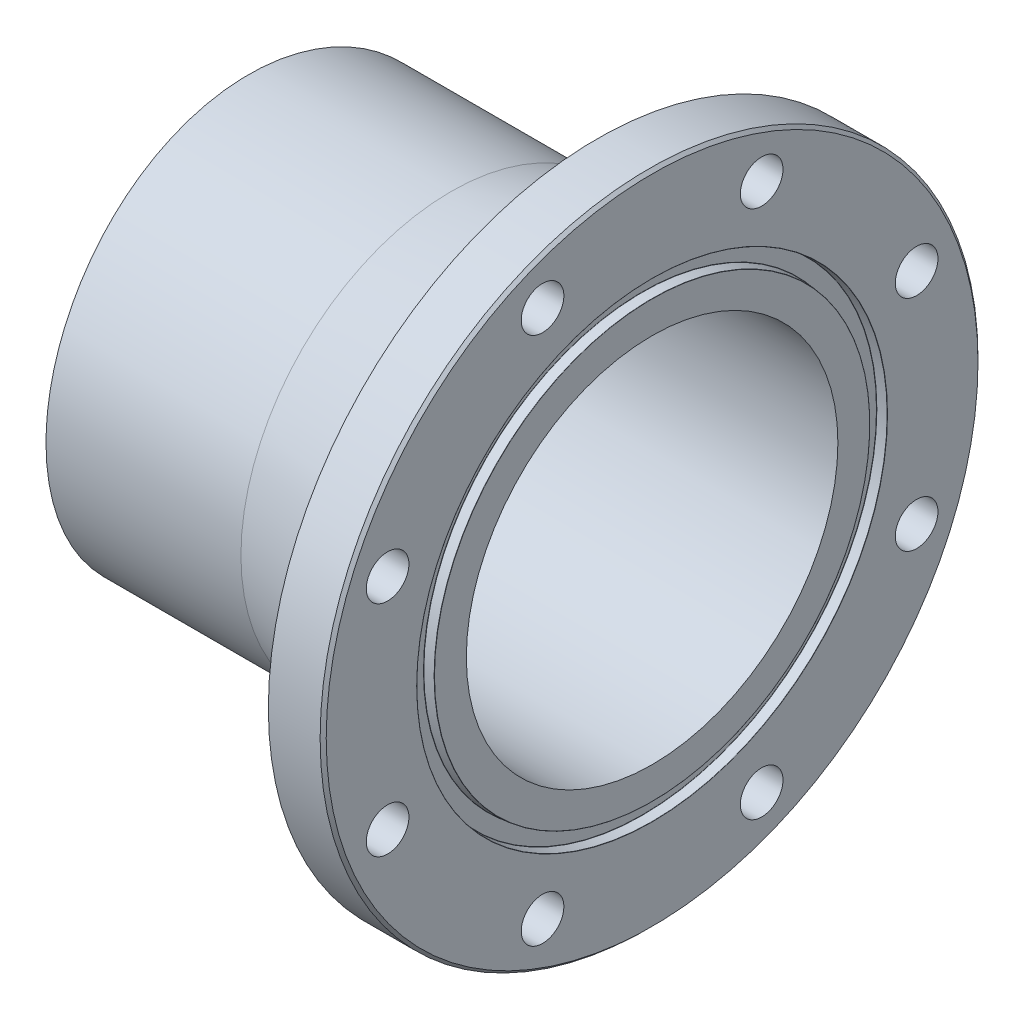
ISO-10303-21;
HEADER;
FILE_DESCRIPTION(('STEP AP214'),'2;1');
FILE_NAME('part.step','',(''),(''),'','','');
FILE_SCHEMA(('AUTOMOTIVE_DESIGN { 1 0 10303 214 1 1 1 1 }'));
ENDSEC;
DATA;
#1=APPLICATION_CONTEXT('core data for automotive mechanical design processes');
#2=APPLICATION_PROTOCOL_DEFINITION('international standard','automotive_design',2000,#1);
#3=PRODUCT_CONTEXT('',#1,'mechanical');
#4=PRODUCT('Part','Part','',(#3));
#5=PRODUCT_RELATED_PRODUCT_CATEGORY('part','',(#4));
#6=PRODUCT_DEFINITION_FORMATION('','',#4);
#7=PRODUCT_DEFINITION_CONTEXT('part definition',#1,'design');
#8=PRODUCT_DEFINITION('design','',#6,#7);
#9=PRODUCT_DEFINITION_SHAPE('','',#8);
#10=(LENGTH_UNIT() NAMED_UNIT(*) SI_UNIT(.MILLI.,.METRE.));
#11=(NAMED_UNIT(*) PLANE_ANGLE_UNIT() SI_UNIT($,.RADIAN.));
#12=(NAMED_UNIT(*) SI_UNIT($,.STERADIAN.) SOLID_ANGLE_UNIT());
#13=UNCERTAINTY_MEASURE_WITH_UNIT(LENGTH_MEASURE(1.E-05),#10,'distance_accuracy_value','');
#14=(GEOMETRIC_REPRESENTATION_CONTEXT(3) GLOBAL_UNCERTAINTY_ASSIGNED_CONTEXT((#13)) GLOBAL_UNIT_ASSIGNED_CONTEXT((#10,
#11,#12)) REPRESENTATION_CONTEXT('',''));
#15=CARTESIAN_POINT('',(0.,0.,0.));
#16=DIRECTION('',(0.,0.,1.));
#17=DIRECTION('',(1.,0.,0.));
#18=AXIS2_PLACEMENT_3D('',#15,#16,#17);
#19=CARTESIAN_POINT('',(0.,0.,0.));
#20=DIRECTION('',(-1.,0.,0.));
#21=DIRECTION('',(0.,0.,1.));
#22=AXIS2_PLACEMENT_3D('',#19,#20,#21);
#23=CYLINDRICAL_SURFACE('',#22,96.8375);
#24=CARTESIAN_POINT('',(12.6999999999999,0.,96.8375));
#25=CARTESIAN_POINT('',(12.7000002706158,1.35874619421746,96.8375016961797));
#26=CARTESIAN_POINT('',(12.6981819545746,2.71744447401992,96.8089000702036));
#27=CARTESIAN_POINT('',(12.6909219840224,5.43254151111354,96.6945452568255));
#28=CARTESIAN_POINT('',(12.6854800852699,6.78894010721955,96.6087882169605));
#29=CARTESIAN_POINT('',(12.6710097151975,9.49713625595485,96.3802512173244));
#30=CARTESIAN_POINT('',(12.6619806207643,10.848932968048,96.2374613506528));
#31=CARTESIAN_POINT('',(12.6403989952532,13.5454174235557,95.8951004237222));
#32=CARTESIAN_POINT('',(12.6278461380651,14.8901044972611,95.6955241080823));
#33=CARTESIAN_POINT('',(12.5992923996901,17.5711586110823,95.2397319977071));
#34=CARTESIAN_POINT('',(12.5832881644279,18.9075162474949,94.983461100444));
#35=CARTESIAN_POINT('',(12.5479509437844,21.5683304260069,94.4148268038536));
#36=CARTESIAN_POINT('',(12.5286176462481,22.8927858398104,94.1024581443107));
#37=CARTESIAN_POINT('',(12.4867639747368,25.5271037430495,93.4222600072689));
#38=CARTESIAN_POINT('',(12.4642441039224,26.8369685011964,93.0544392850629));
#39=CARTESIAN_POINT('',(12.4161726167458,29.4401112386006,92.2639244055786));
#40=CARTESIAN_POINT('',(12.3906207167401,30.7333876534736,91.841225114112));
#41=CARTESIAN_POINT('',(12.3366844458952,33.3001598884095,90.9420082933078));
#42=CARTESIAN_POINT('',(12.3083017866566,34.573667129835,90.4655232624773));
#43=CARTESIAN_POINT('',(12.2488896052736,37.0995562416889,89.4593351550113));
#44=CARTESIAN_POINT('',(12.2178598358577,38.3519361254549,88.9296271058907));
#45=CARTESIAN_POINT('',(12.1533780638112,40.8331345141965,87.8180184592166));
#46=CARTESIAN_POINT('',(12.1199262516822,42.0619548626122,87.2361219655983));
#47=CARTESIAN_POINT('',(12.0508322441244,44.4940684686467,86.0210869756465));
#48=CARTESIAN_POINT('',(12.0151898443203,45.6973593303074,85.3879436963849));
#49=CARTESIAN_POINT('',(11.9419809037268,48.0757997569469,84.0717868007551));
#50=CARTESIAN_POINT('',(11.9044150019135,49.2509584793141,83.3887897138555));
#51=CARTESIAN_POINT('',(11.8276145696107,51.5714874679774,81.973963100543));
#52=CARTESIAN_POINT('',(11.7883798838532,52.7168549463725,81.2421290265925));
#53=CARTESIAN_POINT('',(11.6685929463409,56.1049720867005,78.9754008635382));
#54=CARTESIAN_POINT('',(11.5859377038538,58.3003824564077,77.3689232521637));
#55=CARTESIAN_POINT('',(11.4172832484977,62.5508506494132,73.9750065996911));
#56=CARTESIAN_POINT('',(11.3312796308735,64.6057130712,72.1873238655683));
#57=CARTESIAN_POINT('',(11.1584582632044,68.5576759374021,68.4452379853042));
#58=CARTESIAN_POINT('',(11.0716405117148,70.4547761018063,66.490834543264));
#59=CARTESIAN_POINT('',(10.8996507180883,74.0777552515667,62.4291135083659));
#60=CARTESIAN_POINT('',(10.8144787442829,75.8036271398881,60.3217895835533));
#61=CARTESIAN_POINT('',(10.6481987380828,79.0718569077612,55.9691819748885));
#62=CARTESIAN_POINT('',(10.5670907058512,80.614214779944,53.7238982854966));
#63=CARTESIAN_POINT('',(10.4111760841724,83.5056619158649,49.1093244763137));
#64=CARTESIAN_POINT('',(10.336374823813,84.854588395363,46.7399321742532));
#65=CARTESIAN_POINT('',(10.1952793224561,87.3480118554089,41.895670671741));
#66=CARTESIAN_POINT('',(10.1289850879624,88.4925086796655,39.4208013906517));
#67=CARTESIAN_POINT('',(10.0067943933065,90.5688670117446,34.3831914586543));
#68=CARTESIAN_POINT('',(9.95089784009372,91.5007304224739,31.8204515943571));
#69=CARTESIAN_POINT('',(9.8510977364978,93.145139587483,26.6253208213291));
#70=CARTESIAN_POINT('',(9.80719416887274,93.8576856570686,23.9929300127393));
#71=CARTESIAN_POINT('',(9.7326857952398,95.0575088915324,18.6808899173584));
#72=CARTESIAN_POINT('',(9.70206294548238,95.5450917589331,16.0013099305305));
#73=CARTESIAN_POINT('',(9.65490291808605,96.2929071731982,10.6104880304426));
#74=CARTESIAN_POINT('',(9.63836572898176,96.5531399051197,7.89924614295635));
#75=CARTESIAN_POINT('',(9.61984936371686,96.8443762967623,2.46445743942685));
#76=CARTESIAN_POINT('',(9.61787003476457,96.8753823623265,-0.25908924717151));
#77=CARTESIAN_POINT('',(9.62852554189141,96.7079478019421,-5.69909063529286));
#78=CARTESIAN_POINT('',(9.64116036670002,96.5095073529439,-8.4155453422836));
#79=CARTESIAN_POINT('',(9.68065445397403,95.8850677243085,-13.8180580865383));
#80=CARTESIAN_POINT('',(9.7074929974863,95.4593999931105,-16.5041545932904));
#81=CARTESIAN_POINT('',(9.77461790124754,94.3837735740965,-21.8308825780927));
#82=CARTESIAN_POINT('',(9.81490424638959,93.7338151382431,-24.4715141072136));
#83=CARTESIAN_POINT('',(9.90777947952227,92.2142638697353,-29.6885961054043));
#84=CARTESIAN_POINT('',(9.96036842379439,91.3446700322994,-32.2650462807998));
#85=CARTESIAN_POINT('',(10.0763552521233,89.3920659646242,-37.3355132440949));
#86=CARTESIAN_POINT('',(10.139753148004,88.3090555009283,-39.829529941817));
#87=CARTESIAN_POINT('',(10.2756092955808,85.9364722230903,-44.7192825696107));
#88=CARTESIAN_POINT('',(10.3480741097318,84.646749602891,-47.1149456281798));
#89=CARTESIAN_POINT('',(10.4999724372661,81.8704806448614,-51.7891374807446));
#90=CARTESIAN_POINT('',(10.5794059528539,80.3839342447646,-54.0676662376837));
#91=CARTESIAN_POINT('',(10.7429924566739,77.2245441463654,-58.491532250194));
#92=CARTESIAN_POINT('',(10.8271454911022,75.5516986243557,-60.6368682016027));
#93=CARTESIAN_POINT('',(10.9977892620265,72.0315546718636,-64.7791952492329));
#94=CARTESIAN_POINT('',(11.0842800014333,70.184256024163,-66.776186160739));
#95=CARTESIAN_POINT('',(11.2573074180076,66.3248250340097,-70.6111365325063));
#96=CARTESIAN_POINT('',(11.3438439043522,64.3124060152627,-72.4488075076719));
#97=CARTESIAN_POINT('',(11.5143549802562,60.1398291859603,-75.9481155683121));
#98=CARTESIAN_POINT('',(11.5983295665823,57.979671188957,-77.6097524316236));
#99=CARTESIAN_POINT('',(11.7613358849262,53.5269045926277,-80.7451943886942));
#100=CARTESIAN_POINT('',(11.8403676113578,51.2342958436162,-82.2189992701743));
#101=CARTESIAN_POINT('',(11.9912468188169,46.5328694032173,-84.9682820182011));
#102=CARTESIAN_POINT('',(12.0630943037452,44.124051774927,-86.2437599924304));
#103=CARTESIAN_POINT('',(12.1975704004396,39.2071541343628,-88.5873463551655));
#104=CARTESIAN_POINT('',(12.2601985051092,36.6990686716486,-89.6554433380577));
#105=CARTESIAN_POINT('',(12.3744530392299,31.6015786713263,-91.57652734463));
#106=CARTESIAN_POINT('',(12.4260794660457,29.0121741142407,-92.4295143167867));
#107=CARTESIAN_POINT('',(12.5168634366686,23.770504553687,-93.914239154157));
#108=CARTESIAN_POINT('',(12.5560211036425,21.1182401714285,-94.5459792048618));
#109=CARTESIAN_POINT('',(12.620754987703,15.7697405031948,-95.5836673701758));
#110=CARTESIAN_POINT('',(12.6463312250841,13.0735052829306,-95.9896158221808));
#111=CARTESIAN_POINT('',(12.683142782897,7.66104309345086,-96.5722811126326));
#112=CARTESIAN_POINT('',(12.6944030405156,4.94485919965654,-96.7493965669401));
#113=CARTESIAN_POINT('',(12.7023455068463,-0.492798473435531,-96.8744262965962));
#114=CARTESIAN_POINT('',(12.6990277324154,-3.21427224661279,-96.8223408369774));
#115=CARTESIAN_POINT('',(12.6779082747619,-8.64311230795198,-96.4893454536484));
#116=CARTESIAN_POINT('',(12.6601066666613,-11.3504786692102,-96.2084367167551));
#117=CARTESIAN_POINT('',(12.6105243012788,-16.7318446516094,-95.4198199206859));
#118=CARTESIAN_POINT('',(12.5787435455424,-19.4058442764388,-94.912111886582));
#119=CARTESIAN_POINT('',(12.5021350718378,-24.6992814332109,-93.6740581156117));
#120=CARTESIAN_POINT('',(12.4573181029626,-27.3187620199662,-92.9438957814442));
#121=CARTESIAN_POINT('',(12.3558944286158,-32.4868571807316,-91.2660212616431));
#122=CARTESIAN_POINT('',(12.2992877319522,-35.0354718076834,-90.318309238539));
#123=CARTESIAN_POINT('',(12.1758835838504,-40.043821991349,-88.212095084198));
#124=CARTESIAN_POINT('',(12.1090860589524,-42.5035569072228,-87.0535914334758));
#125=CARTESIAN_POINT('',(11.9671866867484,-47.3167586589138,-84.534043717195));
#126=CARTESIAN_POINT('',(11.8920848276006,-49.6702253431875,-83.1729993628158));
#127=CARTESIAN_POINT('',(11.7355884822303,-54.2574532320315,-80.2560166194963));
#128=CARTESIAN_POINT('',(11.6541854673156,-56.4910450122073,-78.6998122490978));
#129=CARTESIAN_POINT('',(11.4874804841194,-60.8192456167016,-75.4050265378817));
#130=CARTESIAN_POINT('',(11.402178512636,-62.9138543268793,-73.6664450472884));
#131=CARTESIAN_POINT('',(11.2300880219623,-66.9493154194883,-70.0191936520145));
#132=CARTESIAN_POINT('',(11.1432994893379,-68.8901664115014,-68.1105222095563));
#133=CARTESIAN_POINT('',(10.9706926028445,-72.6043789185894,-64.1365921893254));
#134=CARTESIAN_POINT('',(10.884874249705,-74.3777403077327,-62.0713334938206));
#135=CARTESIAN_POINT('',(10.7165168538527,-77.7468481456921,-57.7957396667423));
#136=CARTESIAN_POINT('',(10.6339827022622,-79.3423356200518,-55.585200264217));
#137=CARTESIAN_POINT('',(10.4746705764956,-82.3414111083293,-51.0373661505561));
#138=CARTESIAN_POINT('',(10.3978926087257,-83.7449989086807,-48.7000712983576));
#139=CARTESIAN_POINT('',(10.2522783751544,-86.3502591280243,-43.915309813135));
#140=CARTESIAN_POINT('',(10.1834420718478,-87.5519325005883,-41.4678437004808));
#141=CARTESIAN_POINT('',(10.0556725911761,-89.7447743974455,-36.480109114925));
#142=CARTESIAN_POINT('',(9.99673940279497,-90.7359431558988,-33.939840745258));
#143=CARTESIAN_POINT('',(9.89049760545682,-92.5000048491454,-28.786493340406));
#144=CARTESIAN_POINT('',(9.84318035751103,-93.2730600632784,-26.1734700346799));
#145=CARTESIAN_POINT('',(9.76146359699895,-94.5963208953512,-20.8913929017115));
#146=CARTESIAN_POINT('',(9.72706408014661,-95.1465265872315,-18.2223390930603));
#147=CARTESIAN_POINT('',(9.67216563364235,-96.0201190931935,-12.8472473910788));
#148=CARTESIAN_POINT('',(9.65166658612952,-96.3435078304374,-10.1412098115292));
#149=CARTESIAN_POINT('',(9.62515465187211,-96.7611384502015,-4.71144011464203));
#150=CARTESIAN_POINT('',(9.61914174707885,-96.8553806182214,-1.98770801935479));
#151=CARTESIAN_POINT('',(9.62177157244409,-96.8140750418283,3.453174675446));
#152=CARTESIAN_POINT('',(9.63038835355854,-96.6789341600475,6.17032838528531));
#153=CARTESIAN_POINT('',(9.6619823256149,-96.1806137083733,11.5835562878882));
#154=CARTESIAN_POINT('',(9.68495949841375,-95.817434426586,14.2796305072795));
#155=CARTESIAN_POINT('',(9.74461984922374,-94.8656491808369,19.6315365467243));
#156=CARTESIAN_POINT('',(9.78130304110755,-94.2770429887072,22.2873683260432));
#157=CARTESIAN_POINT('',(9.86733146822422,-92.878629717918,27.5399314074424));
#158=CARTESIAN_POINT('',(9.91667671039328,-92.068822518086,30.136662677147));
#159=CARTESIAN_POINT('',(10.0266260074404,-90.2338134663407,35.2525913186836));
#160=CARTESIAN_POINT('',(10.087229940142,-89.2086139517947,37.771789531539));
#161=CARTESIAN_POINT('',(10.2179762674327,-86.9501384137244,42.7148527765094));
#162=CARTESIAN_POINT('',(10.2881186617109,-85.7168623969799,45.1387178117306));
#163=CARTESIAN_POINT('',(10.4359525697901,-83.051018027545,49.8739558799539));
#164=CARTESIAN_POINT('',(10.5136438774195,-81.6184551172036,52.1853319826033));
#165=CARTESIAN_POINT('',(10.6743739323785,-78.5642612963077,56.6792765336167));
#166=CARTESIAN_POINT('',(10.7574126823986,-76.942630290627,58.8618449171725));
#167=CARTESIAN_POINT('',(10.9266445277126,-73.5185906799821,63.0866139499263));
#168=CARTESIAN_POINT('',(11.0128426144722,-71.7158874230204,65.1285763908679));
#169=CARTESIAN_POINT('',(11.1425459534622,-68.8882100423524,68.0717959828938));
#170=CARTESIAN_POINT('',(11.1858540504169,-67.9249070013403,69.0330384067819));
#171=CARTESIAN_POINT('',(11.2723039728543,-65.9586777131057,70.9140636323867));
#172=CARTESIAN_POINT('',(11.3154458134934,-64.9557551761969,71.8338502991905));
#173=CARTESIAN_POINT('',(11.4012724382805,-62.9116978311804,73.6306473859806));
#174=CARTESIAN_POINT('',(11.4439570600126,-61.8705499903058,74.5076429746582));
#175=CARTESIAN_POINT('',(11.528548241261,-59.7522889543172,76.2169093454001));
#176=CARTESIAN_POINT('',(11.5704548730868,-58.6751791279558,77.0491842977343));
#177=CARTESIAN_POINT('',(11.6531998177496,-56.4867265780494,78.6676776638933));
#178=CARTESIAN_POINT('',(11.6940380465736,-55.3753811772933,79.4538924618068));
#179=CARTESIAN_POINT('',(11.7743492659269,-53.1206086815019,80.97872831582));
#180=CARTESIAN_POINT('',(11.8138223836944,-51.9771845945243,81.7173538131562));
#181=CARTESIAN_POINT('',(11.8911789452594,-49.6586303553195,83.1467318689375));
#182=CARTESIAN_POINT('',(11.9290601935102,-48.4834598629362,83.8374191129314));
#183=CARTESIAN_POINT('',(12.002903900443,-46.1050793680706,85.1685389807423));
#184=CARTESIAN_POINT('',(12.0388665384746,-44.9018720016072,85.8089763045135));
#185=CARTESIAN_POINT('',(12.1086264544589,-42.4692556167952,87.0386203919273));
#186=CARTESIAN_POINT('',(12.142423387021,-41.2398424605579,87.6278189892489));
#187=CARTESIAN_POINT('',(12.2076019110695,-38.7573033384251,88.7537625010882));
#188=CARTESIAN_POINT('',(12.2389837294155,-37.5041796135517,89.2905123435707));
#189=CARTESIAN_POINT('',(12.2990823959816,-34.977583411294,90.3101548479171));
#190=CARTESIAN_POINT('',(12.3278018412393,-33.7041322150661,90.7931000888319));
#191=CARTESIAN_POINT('',(12.3824038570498,-31.138062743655,91.70483244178));
#192=CARTESIAN_POINT('',(12.4082866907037,-29.8454462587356,92.1336245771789));
#193=CARTESIAN_POINT('',(12.4570302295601,-27.2434508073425,92.9362634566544));
#194=CARTESIAN_POINT('',(12.479891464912,-25.9340748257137,93.3101198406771));
#195=CARTESIAN_POINT('',(12.522432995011,-23.3007903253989,94.0022761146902));
#196=CARTESIAN_POINT('',(12.5421135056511,-21.9768827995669,94.320579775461));
#197=CARTESIAN_POINT('',(12.5830871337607,-18.9527329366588,94.9805316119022));
#198=CARTESIAN_POINT('',(12.6033479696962,-17.2486392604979,95.3047351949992));
#199=CARTESIAN_POINT('',(12.638244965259,-13.8258579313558,95.8611123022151));
#200=CARTESIAN_POINT('',(12.6528823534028,-12.1071735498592,96.0933059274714));
#201=CARTESIAN_POINT('',(12.6763710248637,-8.65978100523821,96.4650987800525));
#202=CARTESIAN_POINT('',(12.6852223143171,-6.931072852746,96.6046981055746));
#203=CARTESIAN_POINT('',(12.6970372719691,-3.46821785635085,96.7909077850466));
#204=CARTESIAN_POINT('',(12.6999996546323,-1.73406990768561,96.837497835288));
#205=CARTESIAN_POINT('',(12.6999999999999,0.,96.8375));
#206=B_SPLINE_CURVE_WITH_KNOTS('',3,(#24,#25,#26,#27,#28,#29,#30,#31,#32,#33,#34,#35,#36,#37,
#38,#39,#40,#41,#42,#43,#44,#45,#46,#47,#48,#49,#50,#51,#52,#53,#54,#55,#56,#57,#58,#59,#60,#61,
#62,#63,#64,#65,#66,#67,#68,#69,#70,#71,#72,#73,#74,#75,#76,#77,#78,#79,#80,#81,#82,#83,#84,#85,
#86,#87,#88,#89,#90,#91,#92,#93,#94,#95,#96,#97,#98,#99,#100,#101,#102,#103,#104,#105,#106,#107,
#108,#109,#110,#111,#112,#113,#114,#115,#116,#117,#118,#119,#120,#121,#122,#123,#124,#125,#126,
#127,#128,#129,#130,#131,#132,#133,#134,#135,#136,#137,#138,#139,#140,#141,#142,#143,#144,#145,
#146,#147,#148,#149,#150,#151,#152,#153,#154,#155,#156,#157,#158,#159,#160,#161,#162,#163,#164,
#165,#166,#167,#168,#169,#170,#171,#172,#173,#174,#175,#176,#177,#178,#179,#180,#181,#182,#183,
#184,#185,#186,#187,#188,#189,#190,#191,#192,#193,#194,#195,#196,#197,#198,#199,#200,#201,#202,
#203,#204,#205),.UNSPECIFIED.,.T.,.F.,(4,2,2,2,2,2,2,2,2,2,2,2,2,2,2,2,2,2,2,2,2,2,2,2,2,2,2,2,
2,2,2,2,2,2,2,2,2,2,2,2,2,2,2,2,2,2,2,2,2,2,2,2,2,2,2,2,2,2,2,2,2,2,2,2,2,2,2,2,2,2,2,2,2,2,2,2,
2,2,2,2,2,2,2,2,2,2,2,2,2,2,4),(0.,4.07585354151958,8.15198183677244,12.228818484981,
16.3060325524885,20.3872268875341,24.4688041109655,28.5497375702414,32.6310530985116,
36.709915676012,40.7891596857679,44.8680831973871,48.9473878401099,53.0253460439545,
57.1036845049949,65.2581525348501,73.4237363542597,81.5893346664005,89.7552712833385,
97.9212082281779,106.093977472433,114.266752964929,122.439455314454,130.612145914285,
138.773697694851,146.935242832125,155.096702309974,163.258155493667,171.407736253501,
179.557307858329,187.706916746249,195.856534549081,204.012085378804,212.167638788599,
220.323272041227,228.478915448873,236.649030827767,244.819156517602,252.989291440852,
261.159421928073,269.330001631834,277.500583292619,285.671084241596,293.841572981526,
301.997809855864,310.154037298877,318.310222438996,326.466406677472,334.615884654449,
342.765356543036,350.914887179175,359.064429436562,367.225201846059,375.38598095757,
383.546833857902,391.707692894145,399.880282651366,408.052881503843,416.225441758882,
424.397992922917,432.564447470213,440.730899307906,448.897281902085,457.063654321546,
465.215556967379,473.367449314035,481.519349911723,489.671254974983,497.823071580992,
505.974887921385,514.126481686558,522.278079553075,530.443163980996,534.526823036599,
538.610100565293,542.694783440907,546.779084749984,550.863706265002,554.947946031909,
559.037645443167,563.126961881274,567.216928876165,571.306511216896,575.39206140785,
579.477232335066,583.56168555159,587.645861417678,592.847587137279,598.04817582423,
603.24875899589,608.450477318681),.UNSPECIFIED.);
#207=CARTESIAN_POINT('',(12.6999999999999,0.,96.8375));
#208=VERTEX_POINT('',#207);
#209=EDGE_CURVE('E76',#208,#208,#206,.T.);
#210=ORIENTED_EDGE('',*,*,#209,.T.);
#211=EDGE_LOOP('',(#210));
#212=FACE_BOUND('',#211,.T.);
#213=CARTESIAN_POINT('',(219.075,0.,0.));
#214=DIRECTION('',(-1.,0.,0.));
#215=DIRECTION('',(0.,0.,1.));
#216=AXIS2_PLACEMENT_3D('',#213,#214,#215);
#217=CIRCLE('',#216,96.8375);
#218=CARTESIAN_POINT('',(219.075,0.,96.8375));
#219=VERTEX_POINT('',#218);
#220=EDGE_CURVE('E51',#219,#219,#217,.T.);
#221=ORIENTED_EDGE('',*,*,#220,.F.);
#222=EDGE_LOOP('',(#221));
#223=FACE_BOUND('',#222,.T.);
#224=ADVANCED_FACE('F31',(#212,#223),#23,.F.);
#225=CARTESIAN_POINT('',(219.075,0.,-96.8375));
#226=DIRECTION('',(-1.,0.,0.));
#227=DIRECTION('',(0.,0.,1.));
#228=AXIS2_PLACEMENT_3D('',#225,#226,#227);
#229=PLANE('',#228);
#230=CARTESIAN_POINT('',(219.075,0.,0.));
#231=DIRECTION('',(-1.,0.,0.));
#232=DIRECTION('',(0.,0.,1.));
#233=AXIS2_PLACEMENT_3D('',#230,#231,#232);
#234=CIRCLE('',#233,113.419461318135);
#235=CARTESIAN_POINT('',(219.075,0.,113.419461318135));
#236=VERTEX_POINT('',#235);
#237=EDGE_CURVE('E153',#236,#236,#234,.T.);
#238=ORIENTED_EDGE('',*,*,#237,.F.);
#239=EDGE_LOOP('',(#238));
#240=FACE_BOUND('',#239,.T.);
#241=ORIENTED_EDGE('',*,*,#220,.T.);
#242=EDGE_LOOP('',(#241));
#243=FACE_BOUND('',#242,.T.);
#244=ADVANCED_FACE('F102',(#240,#243),#229,.F.);
#245=CARTESIAN_POINT('',(218.948,0.,0.));
#246=DIRECTION('',(-1.,0.,0.));
#247=DIRECTION('',(0.,0.,1.));
#248=AXIS2_PLACEMENT_3D('',#245,#246,#247);
#249=TOROIDAL_SURFACE('',#248,113.419461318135,0.126999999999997);
#250=CARTESIAN_POINT('',(218.959068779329,0.,0.));
#251=DIRECTION('',(-1.,0.,0.));
#252=DIRECTION('',(0.,0.,1.));
#253=AXIS2_PLACEMENT_3D('',#250,#251,#252);
#254=CIRCLE('',#253,113.545978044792);
#255=CARTESIAN_POINT('',(218.959068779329,0.,113.545978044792));
#256=VERTEX_POINT('',#255);
#257=EDGE_CURVE('E151',#256,#256,#254,.T.);
#258=ORIENTED_EDGE('',*,*,#257,.F.);
#259=EDGE_LOOP('',(#258));
#260=FACE_BOUND('',#259,.T.);
#261=ORIENTED_EDGE('',*,*,#237,.T.);
#262=EDGE_LOOP('',(#261));
#263=FACE_BOUND('',#262,.T.);
#264=ADVANCED_FACE('F162',(#260,#263),#249,.T.);
#265=CARTESIAN_POINT('',(218.959068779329,0.,0.));
#266=DIRECTION('',(-1.,0.,0.));
#267=DIRECTION('',(0.,0.,1.));
#268=AXIS2_PLACEMENT_3D('',#265,#266,#267);
#269=CONICAL_SURFACE('',#268,113.545978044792,0.0872664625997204);
#270=CARTESIAN_POINT('',(214.085531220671,0.,0.));
#271=DIRECTION('',(-1.,0.,0.));
#272=DIRECTION('',(0.,0.,1.));
#273=AXIS2_PLACEMENT_3D('',#270,#271,#272);
#274=CIRCLE('',#273,113.972357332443);
#275=CARTESIAN_POINT('',(214.085531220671,0.,113.972357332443));
#276=VERTEX_POINT('',#275);
#277=EDGE_CURVE('E148',#276,#276,#274,.T.);
#278=ORIENTED_EDGE('',*,*,#277,.F.);
#279=EDGE_LOOP('',(#278));
#280=FACE_BOUND('',#279,.T.);
#281=ORIENTED_EDGE('',*,*,#257,.T.);
#282=EDGE_LOOP('',(#281));
#283=FACE_BOUND('',#282,.T.);
#284=ADVANCED_FACE('F167',(#280,#283),#269,.T.);
#285=CARTESIAN_POINT('',(214.0966,0.,0.));
#286=DIRECTION('',(-1.,0.,0.));
#287=DIRECTION('',(0.,0.,1.));
#288=AXIS2_PLACEMENT_3D('',#285,#286,#287);
#289=TOROIDAL_SURFACE('',#288,114.0988740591,0.126999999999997);
#290=CARTESIAN_POINT('',(213.9696,0.,0.));
#291=DIRECTION('',(-1.,0.,0.));
#292=DIRECTION('',(0.,0.,1.));
#293=AXIS2_PLACEMENT_3D('',#290,#291,#292);
#294=CIRCLE('',#293,114.0988740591);
#295=CARTESIAN_POINT('',(213.9696,0.,114.0988740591));
#296=VERTEX_POINT('',#295);
#297=EDGE_CURVE('E145',#296,#296,#294,.T.);
#298=ORIENTED_EDGE('',*,*,#297,.F.);
#299=EDGE_LOOP('',(#298));
#300=FACE_BOUND('',#299,.T.);
#301=ORIENTED_EDGE('',*,*,#277,.T.);
#302=EDGE_LOOP('',(#301));
#303=FACE_BOUND('',#302,.T.);
#304=ADVANCED_FACE('F172',(#300,#303),#289,.F.);
#305=CARTESIAN_POINT('',(213.9696,0.,-114.0988740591));
#306=DIRECTION('',(-1.,0.,0.));
#307=DIRECTION('',(0.,0.,1.));
#308=AXIS2_PLACEMENT_3D('',#305,#306,#307);
#309=PLANE('',#308);
#310=CARTESIAN_POINT('',(213.9696,0.,0.));
#311=DIRECTION('',(-1.,0.,0.));
#312=DIRECTION('',(0.,0.,1.));
#313=AXIS2_PLACEMENT_3D('',#310,#311,#312);
#314=CIRCLE('',#313,122.0449259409);
#315=CARTESIAN_POINT('',(213.9696,0.,122.0449259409));
#316=VERTEX_POINT('',#315);
#317=EDGE_CURVE('E142',#316,#316,#314,.T.);
#318=ORIENTED_EDGE('',*,*,#317,.F.);
#319=EDGE_LOOP('',(#318));
#320=FACE_BOUND('',#319,.T.);
#321=ORIENTED_EDGE('',*,*,#297,.T.);
#322=EDGE_LOOP('',(#321));
#323=FACE_BOUND('',#322,.T.);
#324=ADVANCED_FACE('F179',(#320,#323),#309,.F.);
#325=CARTESIAN_POINT('',(214.0966,0.,0.));
#326=DIRECTION('',(-1.,0.,0.));
#327=DIRECTION('',(0.,0.,1.));
#328=AXIS2_PLACEMENT_3D('',#325,#326,#327);
#329=TOROIDAL_SURFACE('',#328,122.0449259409,0.126999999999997);
#330=CARTESIAN_POINT('',(214.085531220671,0.,0.));
#331=DIRECTION('',(-1.,0.,0.));
#332=DIRECTION('',(0.,0.,1.));
#333=AXIS2_PLACEMENT_3D('',#330,#331,#332);
#334=CIRCLE('',#333,122.171442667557);
#335=CARTESIAN_POINT('',(214.085531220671,0.,122.171442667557));
#336=VERTEX_POINT('',#335);
#337=EDGE_CURVE('E139',#336,#336,#334,.T.);
#338=ORIENTED_EDGE('',*,*,#337,.F.);
#339=EDGE_LOOP('',(#338));
#340=FACE_BOUND('',#339,.T.);
#341=ORIENTED_EDGE('',*,*,#317,.T.);
#342=EDGE_LOOP('',(#341));
#343=FACE_BOUND('',#342,.T.);
#344=ADVANCED_FACE('F183',(#340,#343),#329,.F.);
#345=CARTESIAN_POINT('',(214.085531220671,0.,0.));
#346=DIRECTION('',(1.,0.,0.));
#347=DIRECTION('',(0.,0.,-1.));
#348=AXIS2_PLACEMENT_3D('',#345,#346,#347);
#349=CONICAL_SURFACE('',#348,122.171442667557,0.0872664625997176);
#350=CARTESIAN_POINT('',(218.959068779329,0.,0.));
#351=DIRECTION('',(-1.,0.,0.));
#352=DIRECTION('',(0.,0.,1.));
#353=AXIS2_PLACEMENT_3D('',#350,#351,#352);
#354=CIRCLE('',#353,122.597821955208);
#355=CARTESIAN_POINT('',(218.959068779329,0.,122.597821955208));
#356=VERTEX_POINT('',#355);
#357=EDGE_CURVE('E134',#356,#356,#354,.T.);
#358=ORIENTED_EDGE('',*,*,#357,.F.);
#359=EDGE_LOOP('',(#358));
#360=FACE_BOUND('',#359,.T.);
#361=ORIENTED_EDGE('',*,*,#337,.T.);
#362=EDGE_LOOP('',(#361));
#363=FACE_BOUND('',#362,.T.);
#364=ADVANCED_FACE('F187',(#360,#363),#349,.F.);
#365=CARTESIAN_POINT('',(218.948,0.,0.));
#366=DIRECTION('',(-1.,0.,0.));
#367=DIRECTION('',(0.,0.,1.));
#368=AXIS2_PLACEMENT_3D('',#365,#366,#367);
#369=TOROIDAL_SURFACE('',#368,122.724338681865,0.126999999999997);
#370=CARTESIAN_POINT('',(219.075,0.,0.));
#371=DIRECTION('',(-1.,0.,0.));
#372=DIRECTION('',(0.,0.,1.));
#373=AXIS2_PLACEMENT_3D('',#370,#371,#372);
#374=CIRCLE('',#373,122.724338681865);
#375=CARTESIAN_POINT('',(219.075,0.,122.724338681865));
#376=VERTEX_POINT('',#375);
#377=EDGE_CURVE('E130',#376,#376,#374,.T.);
#378=ORIENTED_EDGE('',*,*,#377,.F.);
#379=EDGE_LOOP('',(#378));
#380=FACE_BOUND('',#379,.T.);
#381=ORIENTED_EDGE('',*,*,#357,.T.);
#382=EDGE_LOOP('',(#381));
#383=FACE_BOUND('',#382,.T.);
#384=ADVANCED_FACE('F191',(#380,#383),#369,.T.);
#385=CARTESIAN_POINT('',(219.075,0.,-122.724338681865));
#386=DIRECTION('',(-1.,0.,0.));
#387=DIRECTION('',(0.,0.,1.));
#388=AXIS2_PLACEMENT_3D('',#385,#386,#387);
#389=PLANE('',#388);
#390=CARTESIAN_POINT('',(219.075,0.,0.));
#391=DIRECTION('',(-1.,0.,0.));
#392=DIRECTION('',(0.,0.,1.));
#393=AXIS2_PLACEMENT_3D('',#390,#391,#392);
#394=CIRCLE('',#393,169.8625);
#395=CARTESIAN_POINT('',(219.075,0.,169.8625));
#396=VERTEX_POINT('',#395);
#397=EDGE_CURVE('E10',#396,#396,#394,.F.);
#398=ORIENTED_EDGE('',*,*,#397,.T.);
#399=EDGE_LOOP('',(#398));
#400=FACE_BOUND('',#399,.T.);
#401=CARTESIAN_POINT('',(219.075,137.865923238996,57.1059351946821));
#402=DIRECTION('',(1.,0.,0.));
#403=DIRECTION('',(0.,0.,-1.));
#404=AXIS2_PLACEMENT_3D('',#401,#402,#403);
#405=CIRCLE('',#404,11.1125);
#406=CARTESIAN_POINT('',(219.075,137.865923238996,45.9934351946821));
#407=VERTEX_POINT('',#406);
#408=EDGE_CURVE('E56',#407,#407,#405,.T.);
#409=ORIENTED_EDGE('',*,*,#408,.F.);
#410=EDGE_LOOP('',(#409));
#411=FACE_BOUND('',#410,.T.);
#412=CARTESIAN_POINT('',(219.075,137.865923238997,-57.1059351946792));
#413=DIRECTION('',(1.,0.,0.));
#414=DIRECTION('',(0.,0.,-1.));
#415=AXIS2_PLACEMENT_3D('',#412,#413,#414);
#416=CIRCLE('',#415,11.1125);
#417=CARTESIAN_POINT('',(219.075,137.865923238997,-68.2184351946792));
#418=VERTEX_POINT('',#417);
#419=EDGE_CURVE('E55',#418,#418,#416,.T.);
#420=ORIENTED_EDGE('',*,*,#419,.F.);
#421=EDGE_LOOP('',(#420));
#422=FACE_BOUND('',#421,.T.);
#423=CARTESIAN_POINT('',(219.075,57.1059351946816,-137.865923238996));
#424=DIRECTION('',(1.,0.,0.));
#425=DIRECTION('',(0.,0.,-1.));
#426=AXIS2_PLACEMENT_3D('',#423,#424,#425);
#427=CIRCLE('',#426,11.1125);
#428=CARTESIAN_POINT('',(219.075,57.1059351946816,-148.978423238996));
#429=VERTEX_POINT('',#428);
#430=EDGE_CURVE('E60',#429,#429,#427,.T.);
#431=ORIENTED_EDGE('',*,*,#430,.F.);
#432=EDGE_LOOP('',(#431));
#433=FACE_BOUND('',#432,.T.);
#434=CARTESIAN_POINT('',(219.075,-57.1059351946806,-137.865923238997));
#435=DIRECTION('',(1.,0.,0.));
#436=DIRECTION('',(0.,0.,-1.));
#437=AXIS2_PLACEMENT_3D('',#434,#435,#436);
#438=CIRCLE('',#437,11.1125);
#439=CARTESIAN_POINT('',(219.075,-57.1059351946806,-148.978423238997));
#440=VERTEX_POINT('',#439);
#441=EDGE_CURVE('E64',#440,#440,#438,.T.);
#442=ORIENTED_EDGE('',*,*,#441,.F.);
#443=EDGE_LOOP('',(#442));
#444=FACE_BOUND('',#443,.T.);
#445=CARTESIAN_POINT('',(219.075,-137.865923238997,-57.1059351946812));
#446=DIRECTION('',(1.,0.,0.));
#447=DIRECTION('',(0.,0.,-1.));
#448=AXIS2_PLACEMENT_3D('',#445,#446,#447);
#449=CIRCLE('',#448,11.1125);
#450=CARTESIAN_POINT('',(219.075,-137.865923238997,-68.2184351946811));
#451=VERTEX_POINT('',#450);
#452=EDGE_CURVE('E252',#451,#451,#449,.T.);
#453=ORIENTED_EDGE('',*,*,#452,.F.);
#454=EDGE_LOOP('',(#453));
#455=FACE_BOUND('',#454,.T.);
#456=CARTESIAN_POINT('',(219.075,-137.865923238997,57.1059351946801));
#457=DIRECTION('',(1.,0.,0.));
#458=DIRECTION('',(0.,0.,-1.));
#459=AXIS2_PLACEMENT_3D('',#456,#457,#458);
#460=CIRCLE('',#459,11.1125);
#461=CARTESIAN_POINT('',(219.075,-137.865923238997,45.9934351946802));
#462=VERTEX_POINT('',#461);
#463=EDGE_CURVE('E248',#462,#462,#460,.T.);
#464=ORIENTED_EDGE('',*,*,#463,.F.);
#465=EDGE_LOOP('',(#464));
#466=FACE_BOUND('',#465,.T.);
#467=CARTESIAN_POINT('',(219.075,-57.1059351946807,137.865923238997));
#468=DIRECTION('',(1.,0.,0.));
#469=DIRECTION('',(0.,0.,-1.));
#470=AXIS2_PLACEMENT_3D('',#467,#468,#469);
#471=CIRCLE('',#470,11.1125);
#472=CARTESIAN_POINT('',(219.075,-57.1059351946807,126.753423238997));
#473=VERTEX_POINT('',#472);
#474=EDGE_CURVE('E243',#473,#473,#471,.T.);
#475=ORIENTED_EDGE('',*,*,#474,.F.);
#476=EDGE_LOOP('',(#475));
#477=FACE_BOUND('',#476,.T.);
#478=CARTESIAN_POINT('',(219.075,57.1059351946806,137.865923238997));
#479=DIRECTION('',(1.,0.,0.));
#480=DIRECTION('',(0.,0.,-1.));
#481=AXIS2_PLACEMENT_3D('',#478,#479,#480);
#482=CIRCLE('',#481,11.1125);
#483=CARTESIAN_POINT('',(219.075,57.1059351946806,126.753423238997));
#484=VERTEX_POINT('',#483);
#485=EDGE_CURVE('E69',#484,#484,#482,.T.);
#486=ORIENTED_EDGE('',*,*,#485,.F.);
#487=EDGE_LOOP('',(#486));
#488=FACE_BOUND('',#487,.T.);
#489=ORIENTED_EDGE('',*,*,#377,.T.);
#490=EDGE_LOOP('',(#489));
#491=FACE_BOUND('',#490,.T.);
#492=ADVANCED_FACE('F195',(#400,#411,#422,#433,#444,#455,#466,#477,#488,#491),#389,.F.);
#493=CARTESIAN_POINT('',(0.,0.,0.));
#494=DIRECTION('',(-1.,0.,0.));
#495=DIRECTION('',(0.,0.,1.));
#496=AXIS2_PLACEMENT_3D('',#493,#494,#495);
#497=CYLINDRICAL_SURFACE('',#496,171.45);
#498=CARTESIAN_POINT('',(217.4875,0.,0.));
#499=DIRECTION('',(-1.,0.,0.));
#500=DIRECTION('',(0.,0.,1.));
#501=AXIS2_PLACEMENT_3D('',#498,#499,#500);
#502=CIRCLE('',#501,171.45);
#503=CARTESIAN_POINT('',(217.4875,0.,171.45));
#504=VERTEX_POINT('',#503);
#505=EDGE_CURVE('E38',#504,#504,#502,.T.);
#506=ORIENTED_EDGE('',*,*,#505,.T.);
#507=EDGE_LOOP('',(#506));
#508=FACE_BOUND('',#507,.T.);
#509=CARTESIAN_POINT('',(190.5,0.,0.));
#510=DIRECTION('',(-1.,0.,0.));
#511=DIRECTION('',(0.,0.,1.));
#512=AXIS2_PLACEMENT_3D('',#509,#510,#511);
#513=CIRCLE('',#512,171.45);
#514=CARTESIAN_POINT('',(190.5,0.,171.45));
#515=VERTEX_POINT('',#514);
#516=EDGE_CURVE('E128',#515,#515,#513,.T.);
#517=ORIENTED_EDGE('',*,*,#516,.F.);
#518=EDGE_LOOP('',(#517));
#519=FACE_BOUND('',#518,.T.);
#520=ADVANCED_FACE('F199',(#508,#519),#497,.T.);
#521=CARTESIAN_POINT('',(190.5,0.,-171.45));
#522=DIRECTION('',(1.,0.,0.));
#523=DIRECTION('',(0.,0.,-1.));
#524=AXIS2_PLACEMENT_3D('',#521,#522,#523);
#525=PLANE('',#524);
#526=CARTESIAN_POINT('',(190.5,0.,0.));
#527=DIRECTION('',(1.,0.,0.));
#528=DIRECTION('',(0.,0.,-1.));
#529=AXIS2_PLACEMENT_3D('',#526,#527,#528);
#530=CIRCLE('',#529,131.730047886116);
#531=CARTESIAN_POINT('',(190.5,0.,-131.730047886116));
#532=VERTEX_POINT('',#531);
#533=EDGE_CURVE('E42',#532,#532,#530,.T.);
#534=ORIENTED_EDGE('',*,*,#533,.T.);
#535=EDGE_LOOP('',(#534));
#536=FACE_BOUND('',#535,.T.);
#537=CARTESIAN_POINT('',(190.5,137.865923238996,57.1059351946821));
#538=DIRECTION('',(1.,0.,0.));
#539=DIRECTION('',(0.,0.,-1.));
#540=AXIS2_PLACEMENT_3D('',#537,#538,#539);
#541=CIRCLE('',#540,11.1125);
#542=CARTESIAN_POINT('',(190.5,137.865923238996,45.9934351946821));
#543=VERTEX_POINT('',#542);
#544=EDGE_CURVE('E52',#543,#543,#541,.T.);
#545=ORIENTED_EDGE('',*,*,#544,.T.);
#546=EDGE_LOOP('',(#545));
#547=FACE_BOUND('',#546,.T.);
#548=CARTESIAN_POINT('',(190.5,137.865923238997,-57.1059351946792));
#549=DIRECTION('',(1.,0.,0.));
#550=DIRECTION('',(0.,0.,-1.));
#551=AXIS2_PLACEMENT_3D('',#548,#549,#550);
#552=CIRCLE('',#551,11.1125);
#553=CARTESIAN_POINT('',(190.5,137.865923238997,-68.2184351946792));
#554=VERTEX_POINT('',#553);
#555=EDGE_CURVE('E57',#554,#554,#552,.T.);
#556=ORIENTED_EDGE('',*,*,#555,.T.);
#557=EDGE_LOOP('',(#556));
#558=FACE_BOUND('',#557,.T.);
#559=CARTESIAN_POINT('',(190.5,57.1059351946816,-137.865923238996));
#560=DIRECTION('',(1.,0.,0.));
#561=DIRECTION('',(0.,0.,-1.));
#562=AXIS2_PLACEMENT_3D('',#559,#560,#561);
#563=CIRCLE('',#562,11.1125);
#564=CARTESIAN_POINT('',(190.5,57.1059351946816,-148.978423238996));
#565=VERTEX_POINT('',#564);
#566=EDGE_CURVE('E61',#565,#565,#563,.T.);
#567=ORIENTED_EDGE('',*,*,#566,.T.);
#568=EDGE_LOOP('',(#567));
#569=FACE_BOUND('',#568,.T.);
#570=CARTESIAN_POINT('',(190.5,-57.1059351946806,-137.865923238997));
#571=DIRECTION('',(1.,0.,0.));
#572=DIRECTION('',(0.,0.,-1.));
#573=AXIS2_PLACEMENT_3D('',#570,#571,#572);
#574=CIRCLE('',#573,11.1125);
#575=CARTESIAN_POINT('',(190.5,-57.1059351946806,-148.978423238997));
#576=VERTEX_POINT('',#575);
#577=EDGE_CURVE('E217',#576,#576,#574,.T.);
#578=ORIENTED_EDGE('',*,*,#577,.T.);
#579=EDGE_LOOP('',(#578));
#580=FACE_BOUND('',#579,.T.);
#581=CARTESIAN_POINT('',(190.5,-137.865923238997,-57.1059351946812));
#582=DIRECTION('',(1.,0.,0.));
#583=DIRECTION('',(0.,0.,-1.));
#584=AXIS2_PLACEMENT_3D('',#581,#582,#583);
#585=CIRCLE('',#584,11.1125);
#586=CARTESIAN_POINT('',(190.5,-137.865923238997,-68.2184351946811));
#587=VERTEX_POINT('',#586);
#588=EDGE_CURVE('E221',#587,#587,#585,.T.);
#589=ORIENTED_EDGE('',*,*,#588,.T.);
#590=EDGE_LOOP('',(#589));
#591=FACE_BOUND('',#590,.T.);
#592=CARTESIAN_POINT('',(190.5,-137.865923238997,57.1059351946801));
#593=DIRECTION('',(1.,0.,0.));
#594=DIRECTION('',(0.,0.,-1.));
#595=AXIS2_PLACEMENT_3D('',#592,#593,#594);
#596=CIRCLE('',#595,11.1125);
#597=CARTESIAN_POINT('',(190.5,-137.865923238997,45.9934351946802));
#598=VERTEX_POINT('',#597);
#599=EDGE_CURVE('E225',#598,#598,#596,.T.);
#600=ORIENTED_EDGE('',*,*,#599,.T.);
#601=EDGE_LOOP('',(#600));
#602=FACE_BOUND('',#601,.T.);
#603=CARTESIAN_POINT('',(190.5,-57.1059351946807,137.865923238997));
#604=DIRECTION('',(1.,0.,0.));
#605=DIRECTION('',(0.,0.,-1.));
#606=AXIS2_PLACEMENT_3D('',#603,#604,#605);
#607=CIRCLE('',#606,11.1125);
#608=CARTESIAN_POINT('',(190.5,-57.1059351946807,126.753423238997));
#609=VERTEX_POINT('',#608);
#610=EDGE_CURVE('E229',#609,#609,#607,.T.);
#611=ORIENTED_EDGE('',*,*,#610,.T.);
#612=EDGE_LOOP('',(#611));
#613=FACE_BOUND('',#612,.T.);
#614=CARTESIAN_POINT('',(190.5,57.1059351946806,137.865923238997));
#615=DIRECTION('',(1.,0.,0.));
#616=DIRECTION('',(0.,0.,-1.));
#617=AXIS2_PLACEMENT_3D('',#614,#615,#616);
#618=CIRCLE('',#617,11.1125);
#619=CARTESIAN_POINT('',(190.5,57.1059351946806,126.753423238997));
#620=VERTEX_POINT('',#619);
#621=EDGE_CURVE('E65',#620,#620,#618,.T.);
#622=ORIENTED_EDGE('',*,*,#621,.T.);
#623=EDGE_LOOP('',(#622));
#624=FACE_BOUND('',#623,.T.);
#625=ORIENTED_EDGE('',*,*,#516,.T.);
#626=EDGE_LOOP('',(#625));
#627=FACE_BOUND('',#626,.T.);
#628=ADVANCED_FACE('F124',(#536,#547,#558,#569,#580,#591,#602,#613,#624,#627),#525,.F.);
#629=CARTESIAN_POINT('',(190.5,0.,0.));
#630=DIRECTION('',(1.,0.,0.));
#631=DIRECTION('',(0.,0.,-1.));
#632=AXIS2_PLACEMENT_3D('',#629,#630,#631);
#633=CONICAL_SURFACE('',#632,123.825,0.185347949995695);
#634=CARTESIAN_POINT('',(182.730348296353,0.,0.));
#635=DIRECTION('',(1.,0.,0.));
#636=DIRECTION('',(0.,0.,-1.));
#637=AXIS2_PLACEMENT_3D('',#634,#635,#636);
#638=CIRCLE('',#637,122.368190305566);
#639=CARTESIAN_POINT('',(182.730348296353,0.,-122.368190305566));
#640=VERTEX_POINT('',#639);
#641=EDGE_CURVE('E46',#640,#640,#638,.F.);
#642=ORIENTED_EDGE('',*,*,#641,.T.);
#643=EDGE_LOOP('',(#642));
#644=FACE_BOUND('',#643,.T.);
#645=CARTESIAN_POINT('',(114.3,0.,0.));
#646=DIRECTION('',(-1.,0.,0.));
#647=DIRECTION('',(0.,0.,1.));
#648=AXIS2_PLACEMENT_3D('',#645,#646,#647);
#649=CIRCLE('',#648,109.5375);
#650=CARTESIAN_POINT('',(114.3,0.,109.5375));
#651=VERTEX_POINT('',#650);
#652=EDGE_CURVE('E96',#651,#651,#649,.T.);
#653=ORIENTED_EDGE('',*,*,#652,.F.);
#654=EDGE_LOOP('',(#653));
#655=FACE_BOUND('',#654,.T.);
#656=ADVANCED_FACE('F121',(#644,#655),#633,.T.);
#657=CARTESIAN_POINT('',(0.,0.,0.));
#658=DIRECTION('',(-1.,0.,0.));
#659=DIRECTION('',(0.,0.,1.));
#660=AXIS2_PLACEMENT_3D('',#657,#658,#659);
#661=CYLINDRICAL_SURFACE('',#660,109.5375);
#662=CARTESIAN_POINT('',(12.6999999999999,0.,109.5375));
#663=CARTESIAN_POINT('',(12.7000003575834,-1.53647546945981,109.537501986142));
#664=CARTESIAN_POINT('',(12.6976752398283,-3.07289524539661,109.505168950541));
#665=CARTESIAN_POINT('',(12.6883917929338,-6.14313286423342,109.375895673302));
#666=CARTESIAN_POINT('',(12.6814331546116,-7.67695052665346,109.278951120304));
#667=CARTESIAN_POINT('',(12.6629296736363,-10.739376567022,109.020601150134));
#668=CARTESIAN_POINT('',(12.6513840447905,-12.267984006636,108.859184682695));
#669=CARTESIAN_POINT('',(12.6237872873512,-15.3171565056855,108.472165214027));
#670=CARTESIAN_POINT('',(12.6077357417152,-16.8377208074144,108.246556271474));
#671=CARTESIAN_POINT('',(12.5712237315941,-19.869420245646,107.731316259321));
#672=CARTESIAN_POINT('',(12.5507590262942,-21.3805448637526,107.441623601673));
#673=CARTESIAN_POINT('',(12.5055730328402,-24.3893323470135,106.798834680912));
#674=CARTESIAN_POINT('',(12.48085134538,-25.8869939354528,106.445732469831));
#675=CARTESIAN_POINT('',(12.427332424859,-28.8658128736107,105.676840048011));
#676=CARTESIAN_POINT('',(12.3985358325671,-30.3469727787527,105.261059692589));
#677=CARTESIAN_POINT('',(12.3370655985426,-33.2905338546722,104.367476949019));
#678=CARTESIAN_POINT('',(12.304391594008,-34.7529332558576,103.889668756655));
#679=CARTESIAN_POINT('',(12.2354216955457,-37.6553415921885,102.873232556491));
#680=CARTESIAN_POINT('',(12.1991280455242,-39.0953637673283,102.334642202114));
#681=CARTESIAN_POINT('',(12.123155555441,-41.9515220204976,101.197315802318));
#682=CARTESIAN_POINT('',(12.0834763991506,-43.3676558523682,100.598574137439));
#683=CARTESIAN_POINT('',(12.0010198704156,-46.1732855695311,99.3421056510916));
#684=CARTESIAN_POINT('',(11.9582427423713,-47.562783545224,98.6843834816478));
#685=CARTESIAN_POINT('',(11.8698864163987,-50.3129226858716,97.3110291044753));
#686=CARTESIAN_POINT('',(11.8243069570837,-51.6735611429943,96.5953914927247));
#687=CARTESIAN_POINT('',(11.7306858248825,-54.3630360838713,95.1077531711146));
#688=CARTESIAN_POINT('',(11.6826449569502,-55.6918827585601,94.3357708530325));
#689=CARTESIAN_POINT('',(11.5844275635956,-58.3159087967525,92.7366191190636));
#690=CARTESIAN_POINT('',(11.5342508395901,-59.6110850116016,91.9094445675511));
#691=CARTESIAN_POINT('',(11.3810536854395,-63.4423859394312,89.3474249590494));
#692=CARTESIAN_POINT('',(11.2753406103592,-65.9250118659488,87.5316806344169));
#693=CARTESIAN_POINT('',(11.0595879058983,-70.7325204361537,83.6949952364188));
#694=CARTESIAN_POINT('',(10.9495411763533,-73.0571256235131,81.6737080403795));
#695=CARTESIAN_POINT('',(10.7283910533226,-77.5279710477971,77.4425522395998));
#696=CARTESIAN_POINT('',(10.6172876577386,-79.6742109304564,75.2326832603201));
#697=CARTESIAN_POINT('',(10.3971704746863,-83.773120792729,70.6399508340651));
#698=CARTESIAN_POINT('',(10.2881567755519,-85.7257826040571,68.2570800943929));
#699=CARTESIAN_POINT('',(10.0753133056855,-89.423638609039,63.3352292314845));
#700=CARTESIAN_POINT('',(9.97148353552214,-91.168832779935,60.7962490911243));
#701=CARTESIAN_POINT('',(9.771848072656,-94.4411147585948,55.5773003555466));
#702=CARTESIAN_POINT('',(9.67605115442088,-95.9679653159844,52.8971826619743));
#703=CARTESIAN_POINT('',(9.4953363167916,-98.7904141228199,47.4174686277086));
#704=CARTESIAN_POINT('',(9.41041840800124,-100.086012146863,44.6178721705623));
#705=CARTESIAN_POINT('',(9.25388662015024,-102.436645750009,38.9191176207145));
#706=CARTESIAN_POINT('',(9.1822725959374,-103.491683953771,36.0199606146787));
#707=CARTESIAN_POINT('',(9.0543954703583,-105.353613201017,30.1426986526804));
#708=CARTESIAN_POINT('',(8.99813234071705,-106.160504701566,27.1645938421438));
#709=CARTESIAN_POINT('',(8.90265162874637,-107.519121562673,21.1559294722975));
#710=CARTESIAN_POINT('',(8.86340451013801,-108.071289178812,18.1254703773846));
#711=CARTESIAN_POINT('',(8.80293499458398,-108.918537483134,12.0286462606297));
#712=CARTESIAN_POINT('',(8.78171257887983,-109.213618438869,8.96228127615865));
#713=CARTESIAN_POINT('',(8.75789967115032,-109.544554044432,2.81556219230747));
#714=CARTESIAN_POINT('',(8.75530893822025,-109.580412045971,-0.264791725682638));
#715=CARTESIAN_POINT('',(8.76883291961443,-109.392650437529,-6.41753807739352));
#716=CARTESIAN_POINT('',(8.7849476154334,-109.16903108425,-9.48993051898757));
#717=CARTESIAN_POINT('',(8.83537417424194,-108.464594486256,-15.5991244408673));
#718=CARTESIAN_POINT('',(8.86965205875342,-107.984257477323,-18.6359815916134));
#719=CARTESIAN_POINT('',(8.95540766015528,-106.770151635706,-24.6583528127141));
#720=CARTESIAN_POINT('',(9.00688535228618,-106.036383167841,-27.6438669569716));
#721=CARTESIAN_POINT('',(9.12557652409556,-104.320683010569,-33.5424087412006));
#722=CARTESIAN_POINT('',(9.19279009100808,-103.338749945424,-36.4554359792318));
#723=CARTESIAN_POINT('',(9.34104377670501,-101.133753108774,-42.1883884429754));
#724=CARTESIAN_POINT('',(9.42208391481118,-99.910689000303,-45.0083135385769));
#725=CARTESIAN_POINT('',(9.59577365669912,-97.2309060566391,-50.537733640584));
#726=CARTESIAN_POINT('',(9.68843398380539,-95.7739710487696,-53.2471235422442));
#727=CARTESIAN_POINT('',(9.88267729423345,-92.6376254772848,-58.5335810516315));
#728=CARTESIAN_POINT('',(9.98426028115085,-90.958214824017,-61.1106486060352));
#729=CARTESIAN_POINT('',(10.1934745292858,-87.3887967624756,-66.1143453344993));
#730=CARTESIAN_POINT('',(10.3011058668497,-85.4987866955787,-68.540972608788));
#731=CARTESIAN_POINT('',(10.5193730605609,-81.5215367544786,-73.2266794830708));
#732=CARTESIAN_POINT('',(10.6300089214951,-79.4342965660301,-75.4857588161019));
#733=CARTESIAN_POINT('',(10.8514122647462,-75.0723415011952,-79.8253948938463));
#734=CARTESIAN_POINT('',(10.9621794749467,-72.7972114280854,-81.9055343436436));
#735=CARTESIAN_POINT('',(11.1804533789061,-68.0796840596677,-85.8667993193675));
#736=CARTESIAN_POINT('',(11.2879600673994,-65.6372864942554,-87.7479245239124));
#737=CARTESIAN_POINT('',(11.4966657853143,-60.6024878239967,-91.2978098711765));
#738=CARTESIAN_POINT('',(11.5978648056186,-58.0100865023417,-92.966569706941));
#739=CARTESIAN_POINT('',(11.7910858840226,-52.6936274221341,-96.0798355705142));
#740=CARTESIAN_POINT('',(11.8831079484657,-49.9695697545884,-97.5243417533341));
#741=CARTESIAN_POINT('',(12.0553713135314,-44.4088937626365,-100.178873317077));
#742=CARTESIAN_POINT('',(12.1356117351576,-41.5722670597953,-101.388881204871));
#743=CARTESIAN_POINT('',(12.2820254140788,-35.80679277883,-103.565593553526));
#744=CARTESIAN_POINT('',(12.3481986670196,-32.8779451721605,-104.532297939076));
#745=CARTESIAN_POINT('',(12.4645967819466,-26.9489228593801,-106.215422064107));
#746=CARTESIAN_POINT('',(12.5148218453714,-23.948749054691,-106.931844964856));
#747=CARTESIAN_POINT('',(12.5978962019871,-17.8984521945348,-108.10923802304));
#748=CARTESIAN_POINT('',(12.630745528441,-14.8483292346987,-108.570208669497));
#749=CARTESIAN_POINT('',(12.678080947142,-8.72677500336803,-109.232615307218));
#750=CARTESIAN_POINT('',(12.6926078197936,-5.65540640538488,-109.434627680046));
#751=CARTESIAN_POINT('',(12.7030211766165,0.493466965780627,-109.579549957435));
#752=CARTESIAN_POINT('',(12.6989076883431,3.57097172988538,-109.522460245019));
#753=CARTESIAN_POINT('',(12.6721570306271,9.71016662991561,-109.149593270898));
#754=CARTESIAN_POINT('',(12.6495199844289,12.7718568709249,-108.833817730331));
#755=CARTESIAN_POINT('',(12.5863638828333,18.8576390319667,-107.945864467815));
#756=CARTESIAN_POINT('',(12.5458448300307,21.881730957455,-107.373686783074));
#757=CARTESIAN_POINT('',(12.4481241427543,27.8676438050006,-105.97779632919));
#758=CARTESIAN_POINT('',(12.3909401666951,30.8295271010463,-105.154349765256));
#759=CARTESIAN_POINT('',(12.261488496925,36.6733321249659,-103.261627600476));
#760=CARTESIAN_POINT('',(12.1892208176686,39.5552539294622,-102.192352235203));
#761=CARTESIAN_POINT('',(12.0316403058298,45.218800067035,-99.8156065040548));
#762=CARTESIAN_POINT('',(11.9463273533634,48.0004234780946,-98.5081339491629));
#763=CARTESIAN_POINT('',(11.7650621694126,53.4437388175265,-95.6643088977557));
#764=CARTESIAN_POINT('',(11.6691099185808,56.1054305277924,-94.1279559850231));
#765=CARTESIAN_POINT('',(11.4690939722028,61.2947116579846,-90.8343706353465));
#766=CARTESIAN_POINT('',(11.3650163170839,63.8220571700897,-89.0767547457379));
#767=CARTESIAN_POINT('',(11.1518389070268,68.7197778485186,-85.3552308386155));
#768=CARTESIAN_POINT('',(11.0427391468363,71.0901528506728,-83.3913226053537));
#769=CARTESIAN_POINT('',(10.8225996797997,75.6572514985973,-79.2710729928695));
#770=CARTESIAN_POINT('',(10.7115599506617,77.8539731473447,-77.1147294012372));
#771=CARTESIAN_POINT('',(10.4906812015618,82.0582426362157,-72.624840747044));
#772=CARTESIAN_POINT('',(10.380842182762,84.0657902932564,-70.291295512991));
#773=CARTESIAN_POINT('',(10.1652742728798,87.8810442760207,-65.4589963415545));
#774=CARTESIAN_POINT('',(10.059553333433,89.6883753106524,-62.9599457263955));
#775=CARTESIAN_POINT('',(9.85544243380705,93.0860773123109,-57.8181776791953));
#776=CARTESIAN_POINT('',(9.7570524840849,94.676447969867,-55.1754600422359));
#777=CARTESIAN_POINT('',(9.57040634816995,97.6288696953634,-49.7650965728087));
#778=CARTESIAN_POINT('',(9.48215010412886,98.9909220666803,-46.9974514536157));
#779=CARTESIAN_POINT('',(9.31828878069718,101.476956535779,-41.3568652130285));
#780=CARTESIAN_POINT('',(9.24268368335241,102.600938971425,-38.4839242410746));
#781=CARTESIAN_POINT('',(9.106349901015,104.601800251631,-32.6559414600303));
#782=CARTESIAN_POINT('',(9.04560721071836,105.478911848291,-29.7009798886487));
#783=CARTESIAN_POINT('',(8.94064132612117,106.981120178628,-23.7273872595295));
#784=CARTESIAN_POINT('',(8.89641812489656,107.606217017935,-20.7087562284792));
#785=CARTESIAN_POINT('',(8.82575706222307,108.599867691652,-14.6293897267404));
#786=CARTESIAN_POINT('',(8.79931899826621,108.968424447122,-11.5686547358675));
#787=CARTESIAN_POINT('',(8.76498473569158,109.446333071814,-5.42691300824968));
#788=CARTESIAN_POINT('',(8.75708850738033,109.555685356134,-2.34590630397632));
#789=CARTESIAN_POINT('',(8.76006057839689,109.514440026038,3.80735719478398));
#790=CARTESIAN_POINT('',(8.77088633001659,109.364431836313,6.87961797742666));
#791=CARTESIAN_POINT('',(8.81091162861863,108.806683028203,13.0005295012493));
#792=CARTESIAN_POINT('',(8.84011114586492,108.398942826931,16.0491802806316));
#793=CARTESIAN_POINT('',(8.91605155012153,107.328672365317,22.101202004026));
#794=CARTESIAN_POINT('',(8.96279244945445,106.666141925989,25.1045729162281));
#795=CARTESIAN_POINT('',(9.0724844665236,105.091060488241,31.0447178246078));
#796=CARTESIAN_POINT('',(9.1354355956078,104.178509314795,33.9814917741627));
#797=CARTESIAN_POINT('',(9.27575600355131,102.109959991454,39.7675628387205));
#798=CARTESIAN_POINT('',(9.35312488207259,100.953968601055,42.6168623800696));
#799=CARTESIAN_POINT('',(9.52008520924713,98.4067905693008,48.2079322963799));
#800=CARTESIAN_POINT('',(9.60967665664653,97.0156039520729,50.9497026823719));
#801=CARTESIAN_POINT('',(9.79854246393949,94.0079412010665,56.3063499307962));
#802=CARTESIAN_POINT('',(9.8978165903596,92.3914704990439,58.9212298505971));
#803=CARTESIAN_POINT('',(10.1032363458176,88.944771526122,64.0056710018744));
#804=CARTESIAN_POINT('',(10.2093819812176,87.1145430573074,66.475232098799));
#805=CARTESIAN_POINT('',(10.4257978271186,83.2487170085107,71.2571724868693));
#806=CARTESIAN_POINT('',(10.5360763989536,81.2126871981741,73.5692031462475));
#807=CARTESIAN_POINT('',(10.702044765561,78.0186739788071,76.9020247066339));
#808=CARTESIAN_POINT('',(10.7574669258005,76.9305163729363,77.9905674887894));
#809=CARTESIAN_POINT('',(10.8681088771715,74.7093320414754,80.1208236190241));
#810=CARTESIAN_POINT('',(10.9233286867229,73.5763095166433,81.1625413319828));
#811=CARTESIAN_POINT('',(11.0331939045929,71.2669877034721,83.1976572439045));
#812=CARTESIAN_POINT('',(11.0878391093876,70.0906737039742,84.1910387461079));
#813=CARTESIAN_POINT('',(11.1961444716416,67.6973030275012,86.1272782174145));
#814=CARTESIAN_POINT('',(11.2498047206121,66.4802501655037,87.0701408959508));
#815=CARTESIAN_POINT('',(11.3557687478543,64.0073558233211,88.9038353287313));
#816=CARTESIAN_POINT('',(11.4080724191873,62.7515113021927,89.7946629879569));
#817=CARTESIAN_POINT('',(11.5109432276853,60.2034614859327,91.5225460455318));
#818=CARTESIAN_POINT('',(11.5615105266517,58.9112595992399,92.3596064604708));
#819=CARTESIAN_POINT('',(11.6606326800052,56.29061519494,93.9798248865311));
#820=CARTESIAN_POINT('',(11.709184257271,54.9621190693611,94.7628963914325));
#821=CARTESIAN_POINT('',(11.8038408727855,52.2733141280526,96.2722247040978));
#822=CARTESIAN_POINT('',(11.8499461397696,50.9130083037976,96.9984868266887));
#823=CARTESIAN_POINT('',(11.9393940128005,48.1626607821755,98.3930877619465));
#824=CARTESIAN_POINT('',(11.982736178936,46.7726143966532,99.0614173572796));
#825=CARTESIAN_POINT('',(12.0663372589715,43.965598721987,100.3387639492));
#826=CARTESIAN_POINT('',(12.1065964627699,42.5486319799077,100.947786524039));
#827=CARTESIAN_POINT('',(12.1837116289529,39.6915677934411,102.10492872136));
#828=CARTESIAN_POINT('',(12.2205708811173,38.2514943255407,102.65310732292));
#829=CARTESIAN_POINT('',(12.2906650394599,35.3495649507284,103.688211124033));
#830=CARTESIAN_POINT('',(12.3239002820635,33.8877110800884,104.175142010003));
#831=CARTESIAN_POINT('',(12.3865085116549,30.9449385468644,105.086854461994));
#832=CARTESIAN_POINT('',(12.4158821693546,29.4640232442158,105.511646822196));
#833=CARTESIAN_POINT('',(12.4705630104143,26.4856545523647,106.298384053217));
#834=CARTESIAN_POINT('',(12.4958704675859,24.9882022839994,106.660333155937));
#835=CARTESIAN_POINT('',(12.5487442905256,21.5572553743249,107.413397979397));
#836=CARTESIAN_POINT('',(12.5749536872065,19.6192503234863,107.784225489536));
#837=CARTESIAN_POINT('',(12.6200989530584,15.7264297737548,108.420627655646));
#838=CARTESIAN_POINT('',(12.6390364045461,13.7716180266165,108.686225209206));
#839=CARTESIAN_POINT('',(12.6694264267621,9.85045220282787,109.111509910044));
#840=CARTESIAN_POINT('',(12.6808790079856,7.88409814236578,109.271197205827));
#841=CARTESIAN_POINT('',(12.6961663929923,3.94513296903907,109.484202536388));
#842=CARTESIAN_POINT('',(12.6999995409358,1.97252058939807,109.5374974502));
#843=CARTESIAN_POINT('',(12.6999999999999,0.,109.5375));
#844=B_SPLINE_CURVE_WITH_KNOTS('',3,(#662,#663,#664,#665,#666,#667,#668,#669,#670,#671,#672,
#673,#674,#675,#676,#677,#678,#679,#680,#681,#682,#683,#684,#685,#686,#687,#688,#689,#690,#691,
#692,#693,#694,#695,#696,#697,#698,#699,#700,#701,#702,#703,#704,#705,#706,#707,#708,#709,#710,
#711,#712,#713,#714,#715,#716,#717,#718,#719,#720,#721,#722,#723,#724,#725,#726,#727,#728,#729,
#730,#731,#732,#733,#734,#735,#736,#737,#738,#739,#740,#741,#742,#743,#744,#745,#746,#747,#748,
#749,#750,#751,#752,#753,#754,#755,#756,#757,#758,#759,#760,#761,#762,#763,#764,#765,#766,#767,
#768,#769,#770,#771,#772,#773,#774,#775,#776,#777,#778,#779,#780,#781,#782,#783,#784,#785,#786,
#787,#788,#789,#790,#791,#792,#793,#794,#795,#796,#797,#798,#799,#800,#801,#802,#803,#804,#805,
#806,#807,#808,#809,#810,#811,#812,#813,#814,#815,#816,#817,#818,#819,#820,#821,#822,#823,#824,
#825,#826,#827,#828,#829,#830,#831,#832,#833,#834,#835,#836,#837,#838,#839,#840,#841,#842,#843),
.UNSPECIFIED.,.T.,.F.,(4,2,2,2,2,2,2,2,2,2,2,2,2,2,2,2,2,2,2,2,2,2,2,2,2,2,2,2,2,2,2,2,2,2,2,2,
2,2,2,2,2,2,2,2,2,2,2,2,2,2,2,2,2,2,2,2,2,2,2,2,2,2,2,2,2,2,2,2,2,2,2,2,2,2,2,2,2,2,2,2,2,2,2,2,
2,2,2,2,2,2,4),(0.,4.60898821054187,9.21828399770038,13.8283701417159,18.4388831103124,
23.0538464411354,27.669242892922,32.2839143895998,36.8990180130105,41.5112781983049,
46.123969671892,50.7362976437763,55.3490564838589,59.9603163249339,64.5720058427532,
73.7928924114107,83.0295719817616,92.2662698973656,101.503357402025,110.740445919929,
119.987496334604,129.234555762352,138.481514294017,147.728455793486,156.959281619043,
166.190097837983,175.420794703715,184.651482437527,193.864962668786,203.0784296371,
212.291947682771,221.505478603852,230.727575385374,239.949675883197,249.171892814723,
258.394124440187,267.637310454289,276.880511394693,286.123725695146,295.366933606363,
304.610830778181,313.854730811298,323.098514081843,332.342279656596,341.565434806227,
350.788576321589,360.011656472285,369.234735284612,378.448076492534,387.661408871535,
396.874825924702,406.088259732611,415.317886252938,424.547522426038,433.777264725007,
443.00701595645,452.253784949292,461.50056713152,470.747296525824,479.994012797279,
489.231981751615,498.469946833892,507.707806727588,516.945651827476,526.16253051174,
535.379394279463,544.596264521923,553.813141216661,563.029762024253,572.246381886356,
581.462779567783,590.679185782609,599.915367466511,604.534722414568,609.153645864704,
613.774153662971,618.39422997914,623.014669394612,627.634677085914,632.261923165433,
636.888735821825,641.516283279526,646.143395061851,650.765981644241,655.388138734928,
660.009491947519,664.630533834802,670.547544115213,676.463266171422,682.378979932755,
688.295979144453),.UNSPECIFIED.);
#845=CARTESIAN_POINT('',(12.6999999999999,0.,109.5375));
#846=VERTEX_POINT('',#845);
#847=EDGE_CURVE('E68',#846,#846,#844,.T.);
#848=ORIENTED_EDGE('',*,*,#847,.T.);
#849=EDGE_LOOP('',(#848));
#850=FACE_BOUND('',#849,.T.);
#851=ORIENTED_EDGE('',*,*,#652,.T.);
#852=EDGE_LOOP('',(#851));
#853=FACE_BOUND('',#852,.T.);
#854=ADVANCED_FACE('F78',(#850,#853),#661,.T.);
#855=CARTESIAN_POINT('',(-1511.3,0.,-139.7));
#856=DIRECTION('',(0.,0.,1.));
#857=DIRECTION('',(1.,0.,0.));
#858=AXIS2_PLACEMENT_3D('',#855,#856,#857);
#859=CYLINDRICAL_SURFACE('',#858,1524.);
#860=ORIENTED_EDGE('',*,*,#847,.F.);
#861=EDGE_LOOP('',(#860));
#862=FACE_BOUND('',#861,.T.);
#863=ORIENTED_EDGE('',*,*,#209,.F.);
#864=EDGE_LOOP('',(#863));
#865=FACE_BOUND('',#864,.T.);
#866=ADVANCED_FACE('F81',(#862,#865),#859,.F.);
#867=CARTESIAN_POINT('',(219.075,57.1059351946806,137.865923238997));
#868=DIRECTION('',(1.,0.,0.));
#869=DIRECTION('',(0.,0.,-1.));
#870=AXIS2_PLACEMENT_3D('',#867,#868,#869);
#871=CYLINDRICAL_SURFACE('',#870,11.1125);
#872=ORIENTED_EDGE('',*,*,#485,.T.);
#873=EDGE_LOOP('',(#872));
#874=FACE_BOUND('',#873,.T.);
#875=ORIENTED_EDGE('',*,*,#621,.F.);
#876=EDGE_LOOP('',(#875));
#877=FACE_BOUND('',#876,.T.);
#878=ADVANCED_FACE('F85',(#874,#877),#871,.F.);
#879=CARTESIAN_POINT('',(219.075,-57.1059351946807,137.865923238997));
#880=DIRECTION('',(1.,0.,0.));
#881=DIRECTION('',(0.,0.,-1.));
#882=AXIS2_PLACEMENT_3D('',#879,#880,#881);
#883=CYLINDRICAL_SURFACE('',#882,11.1125);
#884=ORIENTED_EDGE('',*,*,#474,.T.);
#885=EDGE_LOOP('',(#884));
#886=FACE_BOUND('',#885,.T.);
#887=ORIENTED_EDGE('',*,*,#610,.F.);
#888=EDGE_LOOP('',(#887));
#889=FACE_BOUND('',#888,.T.);
#890=ADVANCED_FACE('F233',(#886,#889),#883,.F.);
#891=CARTESIAN_POINT('',(219.075,-137.865923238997,57.1059351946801));
#892=DIRECTION('',(1.,0.,0.));
#893=DIRECTION('',(0.,0.,-1.));
#894=AXIS2_PLACEMENT_3D('',#891,#892,#893);
#895=CYLINDRICAL_SURFACE('',#894,11.1125);
#896=ORIENTED_EDGE('',*,*,#463,.T.);
#897=EDGE_LOOP('',(#896));
#898=FACE_BOUND('',#897,.T.);
#899=ORIENTED_EDGE('',*,*,#599,.F.);
#900=EDGE_LOOP('',(#899));
#901=FACE_BOUND('',#900,.T.);
#902=ADVANCED_FACE('F238',(#898,#901),#895,.F.);
#903=CARTESIAN_POINT('',(219.075,-137.865923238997,-57.1059351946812));
#904=DIRECTION('',(1.,0.,0.));
#905=DIRECTION('',(0.,0.,-1.));
#906=AXIS2_PLACEMENT_3D('',#903,#904,#905);
#907=CYLINDRICAL_SURFACE('',#906,11.1125);
#908=ORIENTED_EDGE('',*,*,#452,.T.);
#909=EDGE_LOOP('',(#908));
#910=FACE_BOUND('',#909,.T.);
#911=ORIENTED_EDGE('',*,*,#588,.F.);
#912=EDGE_LOOP('',(#911));
#913=FACE_BOUND('',#912,.T.);
#914=ADVANCED_FACE('F295',(#910,#913),#907,.F.);
#915=CARTESIAN_POINT('',(219.075,-57.1059351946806,-137.865923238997));
#916=DIRECTION('',(1.,0.,0.));
#917=DIRECTION('',(0.,0.,-1.));
#918=AXIS2_PLACEMENT_3D('',#915,#916,#917);
#919=CYLINDRICAL_SURFACE('',#918,11.1125);
#920=ORIENTED_EDGE('',*,*,#441,.T.);
#921=EDGE_LOOP('',(#920));
#922=FACE_BOUND('',#921,.T.);
#923=ORIENTED_EDGE('',*,*,#577,.F.);
#924=EDGE_LOOP('',(#923));
#925=FACE_BOUND('',#924,.T.);
#926=ADVANCED_FACE('F300',(#922,#925),#919,.F.);
#927=CARTESIAN_POINT('',(219.075,57.1059351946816,-137.865923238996));
#928=DIRECTION('',(1.,0.,0.));
#929=DIRECTION('',(0.,0.,-1.));
#930=AXIS2_PLACEMENT_3D('',#927,#928,#929);
#931=CYLINDRICAL_SURFACE('',#930,11.1125);
#932=ORIENTED_EDGE('',*,*,#430,.T.);
#933=EDGE_LOOP('',(#932));
#934=FACE_BOUND('',#933,.T.);
#935=ORIENTED_EDGE('',*,*,#566,.F.);
#936=EDGE_LOOP('',(#935));
#937=FACE_BOUND('',#936,.T.);
#938=ADVANCED_FACE('F306',(#934,#937),#931,.F.);
#939=CARTESIAN_POINT('',(219.075,137.865923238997,-57.1059351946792));
#940=DIRECTION('',(1.,0.,0.));
#941=DIRECTION('',(0.,0.,-1.));
#942=AXIS2_PLACEMENT_3D('',#939,#940,#941);
#943=CYLINDRICAL_SURFACE('',#942,11.1125);
#944=ORIENTED_EDGE('',*,*,#419,.T.);
#945=EDGE_LOOP('',(#944));
#946=FACE_BOUND('',#945,.T.);
#947=ORIENTED_EDGE('',*,*,#555,.F.);
#948=EDGE_LOOP('',(#947));
#949=FACE_BOUND('',#948,.T.);
#950=ADVANCED_FACE('F114',(#946,#949),#943,.F.);
#951=CARTESIAN_POINT('',(219.075,137.865923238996,57.1059351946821));
#952=DIRECTION('',(1.,0.,0.));
#953=DIRECTION('',(0.,0.,-1.));
#954=AXIS2_PLACEMENT_3D('',#951,#952,#953);
#955=CYLINDRICAL_SURFACE('',#954,11.1125);
#956=ORIENTED_EDGE('',*,*,#408,.T.);
#957=EDGE_LOOP('',(#956));
#958=FACE_BOUND('',#957,.T.);
#959=ORIENTED_EDGE('',*,*,#544,.F.);
#960=EDGE_LOOP('',(#959));
#961=FACE_BOUND('',#960,.T.);
#962=ADVANCED_FACE('F107',(#958,#961),#955,.F.);
#963=CARTESIAN_POINT('',(180.975,0.,0.));
#964=DIRECTION('',(1.,0.,0.));
#965=DIRECTION('',(0.,0.,-1.));
#966=AXIS2_PLACEMENT_3D('',#963,#964,#965);
#967=TOROIDAL_SURFACE('',#966,131.730047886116,9.525);
#968=ORIENTED_EDGE('',*,*,#533,.F.);
#969=EDGE_LOOP('',(#968));
#970=FACE_BOUND('',#969,.T.);
#971=ORIENTED_EDGE('',*,*,#641,.F.);
#972=EDGE_LOOP('',(#971));
#973=FACE_BOUND('',#972,.T.);
#974=ADVANCED_FACE('F105',(#970,#973),#967,.F.);
#975=CARTESIAN_POINT('',(217.4875,0.,0.));
#976=DIRECTION('',(-1.,0.,0.));
#977=DIRECTION('',(0.,0.,1.));
#978=AXIS2_PLACEMENT_3D('',#975,#976,#977);
#979=CONICAL_SURFACE('',#978,171.45,0.785398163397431);
#980=CARTESIAN_POINT('',(219.075,0.,169.8625));
#981=CARTESIAN_POINT('',(219.058463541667,0.,169.879036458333));
#982=CARTESIAN_POINT('',(219.041927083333,0.,169.895572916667));
#983=CARTESIAN_POINT('',(219.008854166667,0.,169.928645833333));
#984=CARTESIAN_POINT('',(218.992317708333,0.,169.945182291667));
#985=CARTESIAN_POINT('',(218.959244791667,0.,169.978255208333));
#986=CARTESIAN_POINT('',(218.942708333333,0.,169.994791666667));
#987=CARTESIAN_POINT('',(218.909635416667,0.,170.027864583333));
#988=CARTESIAN_POINT('',(218.893098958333,0.,170.044401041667));
#989=CARTESIAN_POINT('',(218.860026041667,0.,170.077473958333));
#990=CARTESIAN_POINT('',(218.843489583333,0.,170.094010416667));
#991=CARTESIAN_POINT('',(218.810416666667,0.,170.127083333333));
#992=CARTESIAN_POINT('',(218.793880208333,0.,170.143619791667));
#993=CARTESIAN_POINT('',(218.760807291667,0.,170.176692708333));
#994=CARTESIAN_POINT('',(218.744270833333,0.,170.193229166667));
#995=CARTESIAN_POINT('',(218.711197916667,0.,170.226302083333));
#996=CARTESIAN_POINT('',(218.694661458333,0.,170.242838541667));
#997=CARTESIAN_POINT('',(218.661588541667,0.,170.275911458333));
#998=CARTESIAN_POINT('',(218.645052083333,0.,170.292447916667));
#999=CARTESIAN_POINT('',(218.611979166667,0.,170.325520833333));
#1000=CARTESIAN_POINT('',(218.595442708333,0.,170.342057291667));
#1001=CARTESIAN_POINT('',(218.562369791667,0.,170.375130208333));
#1002=CARTESIAN_POINT('',(218.545833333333,0.,170.391666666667));
#1003=CARTESIAN_POINT('',(218.512760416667,0.,170.424739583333));
#1004=CARTESIAN_POINT('',(218.496223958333,0.,170.441276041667));
#1005=CARTESIAN_POINT('',(218.463151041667,0.,170.474348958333));
#1006=CARTESIAN_POINT('',(218.446614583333,0.,170.490885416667));
#1007=CARTESIAN_POINT('',(218.413541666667,0.,170.523958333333));
#1008=CARTESIAN_POINT('',(218.397005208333,0.,170.540494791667));
#1009=CARTESIAN_POINT('',(218.363932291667,0.,170.573567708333));
#1010=CARTESIAN_POINT('',(218.347395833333,0.,170.590104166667));
#1011=CARTESIAN_POINT('',(218.314322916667,0.,170.623177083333));
#1012=CARTESIAN_POINT('',(218.297786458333,0.,170.639713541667));
#1013=CARTESIAN_POINT('',(218.264713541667,0.,170.672786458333));
#1014=CARTESIAN_POINT('',(218.248177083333,0.,170.689322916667));
#1015=CARTESIAN_POINT('',(218.215104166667,0.,170.722395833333));
#1016=CARTESIAN_POINT('',(218.198567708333,0.,170.738932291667));
#1017=CARTESIAN_POINT('',(218.165494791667,0.,170.772005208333));
#1018=CARTESIAN_POINT('',(218.148958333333,0.,170.788541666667));
#1019=CARTESIAN_POINT('',(218.115885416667,0.,170.821614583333));
#1020=CARTESIAN_POINT('',(218.099348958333,0.,170.838151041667));
#1021=CARTESIAN_POINT('',(218.066276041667,0.,170.871223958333));
#1022=CARTESIAN_POINT('',(218.049739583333,0.,170.887760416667));
#1023=CARTESIAN_POINT('',(218.016666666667,0.,170.920833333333));
#1024=CARTESIAN_POINT('',(218.000130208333,0.,170.937369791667));
#1025=CARTESIAN_POINT('',(217.967057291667,0.,170.970442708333));
#1026=CARTESIAN_POINT('',(217.950520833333,0.,170.986979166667));
#1027=CARTESIAN_POINT('',(217.917447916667,0.,171.020052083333));
#1028=CARTESIAN_POINT('',(217.900911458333,0.,171.036588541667));
#1029=CARTESIAN_POINT('',(217.867838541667,0.,171.069661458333));
#1030=CARTESIAN_POINT('',(217.851302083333,0.,171.086197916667));
#1031=CARTESIAN_POINT('',(217.818229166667,0.,171.119270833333));
#1032=CARTESIAN_POINT('',(217.801692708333,0.,171.135807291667));
#1033=CARTESIAN_POINT('',(217.768619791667,0.,171.168880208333));
#1034=CARTESIAN_POINT('',(217.752083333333,0.,171.185416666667));
#1035=CARTESIAN_POINT('',(217.719010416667,0.,171.218489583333));
#1036=CARTESIAN_POINT('',(217.702473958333,0.,171.235026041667));
#1037=CARTESIAN_POINT('',(217.669401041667,0.,171.268098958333));
#1038=CARTESIAN_POINT('',(217.652864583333,0.,171.284635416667));
#1039=CARTESIAN_POINT('',(217.619791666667,0.,171.317708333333));
#1040=CARTESIAN_POINT('',(217.603255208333,0.,171.334244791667));
#1041=CARTESIAN_POINT('',(217.570182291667,0.,171.367317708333));
#1042=CARTESIAN_POINT('',(217.553645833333,0.,171.383854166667));
#1043=CARTESIAN_POINT('',(217.520572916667,0.,171.416927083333));
#1044=CARTESIAN_POINT('',(217.504036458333,0.,171.433463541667));
#1045=CARTESIAN_POINT('',(217.4875,0.,171.45));
#1046=B_SPLINE_CURVE_WITH_KNOTS('',3,(#980,#981,#982,#983,#984,#985,#986,#987,#988,#989,#990,
#991,#992,#993,#994,#995,#996,#997,#998,#999,#1000,#1001,#1002,#1003,#1004,#1005,#1006,#1007,
#1008,#1009,#1010,#1011,#1012,#1013,#1014,#1015,#1016,#1017,#1018,#1019,#1020,#1021,#1022,#1023,
#1024,#1025,#1026,#1027,#1028,#1029,#1030,#1031,#1032,#1033,#1034,#1035,#1036,#1037,#1038,#1039,
#1040,#1041,#1042,#1043,#1044,#1045),.UNSPECIFIED.,.F.,.F.,(4,2,2,2,2,2,2,2,2,2,2,2,2,2,2,2,2,2,
2,2,2,2,2,2,2,2,2,2,2,2,2,2,4),(0.,0.0701582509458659,0.140316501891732,0.210474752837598,
0.280633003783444,0.35079125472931,0.420949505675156,0.491107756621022,0.561266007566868,
0.631424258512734,0.7015825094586,0.771740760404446,0.841899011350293,0.912057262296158,
0.982215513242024,1.05237376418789,1.12253201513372,1.19269026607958,1.26284851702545,
1.33300676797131,1.40316501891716,1.47332326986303,1.54348152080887,1.61363977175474,
1.68379802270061,1.75395627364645,1.82411452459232,1.89427277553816,1.96443102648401,
2.03458927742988,2.10474752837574,2.17490577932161,2.24506403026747),.UNSPECIFIED.);
#1047=EDGE_CURVE('BSEAM33',#396,#504,#1046,.T.);
#1048=ORIENTED_EDGE('',*,*,#397,.F.);
#1049=ORIENTED_EDGE('',*,*,#505,.F.);
#1050=ORIENTED_EDGE('',*,*,#1047,.T.);
#1051=ORIENTED_EDGE('',*,*,#1047,.F.);
#1052=EDGE_LOOP('',(#1048,#1050,#1049,#1051));
#1053=FACE_BOUND('',#1052,.T.);
#1054=ADVANCED_FACE('F33',(#1053),#979,.T.);
#1055=CLOSED_SHELL('',(#224,#244,#264,#284,#304,#324,#344,#364,#384,#492,#520,#628,#656,#854,
#866,#878,#890,#902,#914,#926,#938,#950,#962,#974,#1054));
#1056=MANIFOLD_SOLID_BREP('B2',#1055);
#1057=ADVANCED_BREP_SHAPE_REPRESENTATION('',(#18,#1056),#14);
#1058=SHAPE_DEFINITION_REPRESENTATION(#9,#1057);
ENDSEC;
END-ISO-10303-21;
